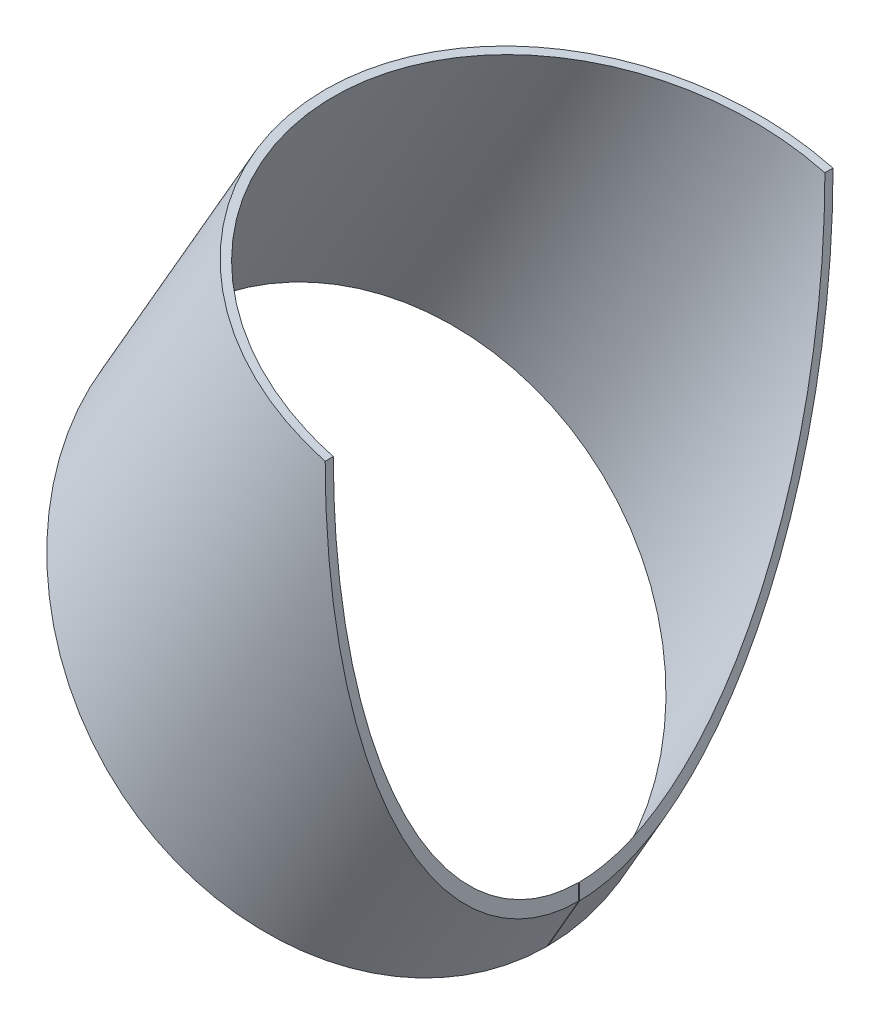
ISO-10303-21;
HEADER;
FILE_DESCRIPTION(('STEP AP214'),'2;1');
FILE_NAME('part.step','',(''),(''),'','','');
FILE_SCHEMA(('AUTOMOTIVE_DESIGN { 1 0 10303 214 1 1 1 1 }'));
ENDSEC;
DATA;
#1=APPLICATION_CONTEXT('core data for automotive mechanical design processes');
#2=APPLICATION_PROTOCOL_DEFINITION('international standard','automotive_design',2000,#1);
#3=PRODUCT_CONTEXT('',#1,'mechanical');
#4=PRODUCT('Part','Part','',(#3));
#5=PRODUCT_RELATED_PRODUCT_CATEGORY('part','',(#4));
#6=PRODUCT_DEFINITION_FORMATION('','',#4);
#7=PRODUCT_DEFINITION_CONTEXT('part definition',#1,'design');
#8=PRODUCT_DEFINITION('design','',#6,#7);
#9=PRODUCT_DEFINITION_SHAPE('','',#8);
#10=(LENGTH_UNIT() NAMED_UNIT(*) SI_UNIT(.MILLI.,.METRE.));
#11=(NAMED_UNIT(*) PLANE_ANGLE_UNIT() SI_UNIT($,.RADIAN.));
#12=(NAMED_UNIT(*) SI_UNIT($,.STERADIAN.) SOLID_ANGLE_UNIT());
#13=UNCERTAINTY_MEASURE_WITH_UNIT(LENGTH_MEASURE(1.E-05),#10,'distance_accuracy_value','');
#14=(GEOMETRIC_REPRESENTATION_CONTEXT(3) GLOBAL_UNCERTAINTY_ASSIGNED_CONTEXT((#13)) GLOBAL_UNIT_ASSIGNED_CONTEXT((#10,
#11,#12)) REPRESENTATION_CONTEXT('',''));
#15=CARTESIAN_POINT('',(0.,0.,0.));
#16=DIRECTION('',(0.,0.,1.));
#17=DIRECTION('',(1.,0.,0.));
#18=AXIS2_PLACEMENT_3D('',#15,#16,#17);
#19=CARTESIAN_POINT('',(33.49364905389,-156.34665205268,0.));
#20=DIRECTION('',(-0.5,-0.866025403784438,0.));
#21=DIRECTION('',(-0.866025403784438,0.500000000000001,0.));
#22=AXIS2_PLACEMENT_3D('',#19,#20,#21);
#23=CYLINDRICAL_SURFACE('',#22,250.);
#24=DIRECTION('',(-0.5,-0.866025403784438,0.));
#25=VECTOR('',#24,1.);
#26=CARTESIAN_POINT('',(249.999566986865,-281.346402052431,-0.500000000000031));
#27=LINE('',#26,#25);
#28=CARTESIAN_POINT('',(-31.3470180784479,-768.652981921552,-0.500000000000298));
#29=VERTEX_POINT('',#28);
#30=CARTESIAN_POINT('',(0.,-714.358353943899,-0.500000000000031));
#31=VERTEX_POINT('',#30);
#32=EDGE_CURVE('E101',#29,#31,#27,.F.);
#33=ORIENTED_EDGE('',*,*,#32,.F.);
#34=CARTESIAN_POINT('',(-214.359353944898,-585.640646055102,0.));
#35=DIRECTION('',(0.707106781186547,0.707106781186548,0.));
#36=DIRECTION('',(0.707106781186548,-0.707106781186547,0.));
#37=AXIS2_PLACEMENT_3D('',#34,#35,#36);
#38=ELLIPSE('',#37,258.819045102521,250.);
#39=CARTESIAN_POINT('',(-31.3470180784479,-768.652981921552,0.500000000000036));
#40=VERTEX_POINT('',#39);
#41=EDGE_CURVE('E97',#40,#29,#38,.F.);
#42=ORIENTED_EDGE('',*,*,#41,.F.);
#43=DIRECTION('',(-0.5,-0.866025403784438,0.));
#44=VECTOR('',#43,1.);
#45=CARTESIAN_POINT('',(249.999566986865,-281.346402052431,0.499999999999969));
#46=LINE('',#45,#44);
#47=CARTESIAN_POINT('',(0.,-714.358353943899,0.499999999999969));
#48=VERTEX_POINT('',#47);
#49=EDGE_CURVE('E82',#40,#48,#46,.F.);
#50=ORIENTED_EDGE('',*,*,#49,.T.);
#51=CARTESIAN_POINT('',(0.,-214.359353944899,0.));
#52=DIRECTION('',(-1.,0.,0.));
#53=DIRECTION('',(0.,-1.,0.));
#54=AXIS2_PLACEMENT_3D('',#51,#52,#53);
#55=ELLIPSE('',#54,500.,250.);
#56=CARTESIAN_POINT('',(0.,-214.3593539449,250.000000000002));
#57=VERTEX_POINT('',#56);
#58=EDGE_CURVE('E88',#57,#48,#55,.F.);
#59=ORIENTED_EDGE('',*,*,#58,.F.);
#60=CARTESIAN_POINT('',(-2.63677968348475E-13,-214.3593539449,0.));
#61=DIRECTION('',(0.258819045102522,0.965925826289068,0.));
#62=DIRECTION('',(-0.965925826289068,0.258819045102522,0.));
#63=AXIS2_PLACEMENT_3D('',#60,#61,#62);
#64=ELLIPSE('',#63,258.819045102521,250.);
#65=CARTESIAN_POINT('',(0.,-214.3593539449,-250.));
#66=VERTEX_POINT('',#65);
#67=EDGE_CURVE('E108',#57,#66,#64,.F.);
#68=ORIENTED_EDGE('',*,*,#67,.T.);
#69=EDGE_CURVE('E94',#31,#66,#55,.F.);
#70=ORIENTED_EDGE('',*,*,#69,.F.);
#71=EDGE_LOOP('',(#33,#42,#50,#59,#68,#70));
#72=FACE_BOUND('',#71,.T.);
#73=ADVANCED_FACE('F30',(#72),#23,.T.);
#74=CARTESIAN_POINT('',(33.49364905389,-156.34665205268,0.));
#75=DIRECTION('',(-0.5,-0.866025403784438,0.));
#76=DIRECTION('',(-0.866025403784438,0.500000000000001,0.));
#77=AXIS2_PLACEMENT_3D('',#74,#75,#76);
#78=CYLINDRICAL_SURFACE('',#77,242.);
#79=CARTESIAN_POINT('',(0.,-214.359353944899,0.));
#80=DIRECTION('',(-1.,0.,0.));
#81=DIRECTION('',(0.,-1.,0.));
#82=AXIS2_PLACEMENT_3D('',#79,#80,#81);
#83=ELLIPSE('',#82,484.,242.);
#84=CARTESIAN_POINT('',(0.,-698.358320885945,-0.50000000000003));
#85=VERTEX_POINT('',#84);
#86=CARTESIAN_POINT('',(0.,-214.3593539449,-242.));
#87=VERTEX_POINT('',#86);
#88=EDGE_CURVE('E122',#85,#87,#83,.F.);
#89=ORIENTED_EDGE('',*,*,#88,.T.);
#90=CARTESIAN_POINT('',(-2.63677968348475E-13,-214.3593539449,0.));
#91=DIRECTION('',(0.258819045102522,0.965925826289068,0.));
#92=DIRECTION('',(-0.965925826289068,0.258819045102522,0.));
#93=AXIS2_PLACEMENT_3D('',#90,#91,#92);
#94=ELLIPSE('',#93,250.53683565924,242.);
#95=CARTESIAN_POINT('',(0.,-214.3593539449,242.000000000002));
#96=VERTEX_POINT('',#95);
#97=EDGE_CURVE('E99',#96,#87,#94,.F.);
#98=ORIENTED_EDGE('',*,*,#97,.F.);
#99=CARTESIAN_POINT('',(0.,-698.358320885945,0.49999999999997));
#100=VERTEX_POINT('',#99);
#101=EDGE_CURVE('E92',#96,#100,#83,.F.);
#102=ORIENTED_EDGE('',*,*,#101,.T.);
#103=DIRECTION('',(-0.5,-0.866025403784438,0.));
#104=VECTOR('',#103,1.);
#105=CARTESIAN_POINT('',(243.071349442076,-277.346393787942,0.49999999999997));
#106=LINE('',#105,#104);
#107=CARTESIAN_POINT('',(-37.2034366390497,-762.79656336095,0.500000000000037));
#108=VERTEX_POINT('',#107);
#109=EDGE_CURVE('E85',#108,#100,#106,.F.);
#110=ORIENTED_EDGE('',*,*,#109,.F.);
#111=CARTESIAN_POINT('',(-214.359353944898,-585.640646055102,0.));
#112=DIRECTION('',(0.707106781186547,0.707106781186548,0.));
#113=DIRECTION('',(0.707106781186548,-0.707106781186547,0.));
#114=AXIS2_PLACEMENT_3D('',#111,#112,#113);
#115=ELLIPSE('',#114,250.53683565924,242.);
#116=CARTESIAN_POINT('',(-37.2034366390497,-762.79656336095,-0.500000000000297));
#117=VERTEX_POINT('',#116);
#118=EDGE_CURVE('E105',#108,#117,#115,.F.);
#119=ORIENTED_EDGE('',*,*,#118,.T.);
#120=DIRECTION('',(-0.5,-0.866025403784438,0.));
#121=VECTOR('',#120,1.);
#122=CARTESIAN_POINT('',(243.071349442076,-277.346393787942,-0.50000000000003));
#123=LINE('',#122,#121);
#124=EDGE_CURVE('E132',#117,#85,#123,.F.);
#125=ORIENTED_EDGE('',*,*,#124,.T.);
#126=EDGE_LOOP('',(#89,#98,#102,#110,#119,#125));
#127=FACE_BOUND('',#126,.T.);
#128=ADVANCED_FACE('F119',(#127),#78,.F.);
#129=CARTESIAN_POINT('',(-800.,0.,2271.05495199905));
#130=DIRECTION('',(-0.258819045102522,-0.965925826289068,0.));
#131=DIRECTION('',(-0.965925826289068,0.258819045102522,0.));
#132=AXIS2_PLACEMENT_3D('',#129,#130,#131);
#133=PLANE('',#132);
#134=DIRECTION('',(0.,0.,-1.));
#135=VECTOR('',#134,1.);
#136=CARTESIAN_POINT('',(0.,-214.3593539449,2271.05495199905));
#137=LINE('',#136,#135);
#138=EDGE_CURVE('E44',#57,#96,#137,.T.);
#139=ORIENTED_EDGE('',*,*,#138,.T.);
#140=ORIENTED_EDGE('',*,*,#97,.T.);
#141=EDGE_CURVE('E126',#87,#66,#137,.T.);
#142=ORIENTED_EDGE('',*,*,#141,.T.);
#143=ORIENTED_EDGE('',*,*,#67,.F.);
#144=EDGE_LOOP('',(#139,#140,#142,#143));
#145=FACE_BOUND('',#144,.T.);
#146=ADVANCED_FACE('F137',(#145),#133,.F.);
#147=CARTESIAN_POINT('',(155.320323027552,54.6633369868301,-0.5));
#148=DIRECTION('',(0.,0.,1.));
#149=DIRECTION('',(-1.,0.,0.));
#150=AXIS2_PLACEMENT_3D('',#147,#148,#149);
#151=PLANE('',#150);
#152=ORIENTED_EDGE('',*,*,#124,.F.);
#153=DIRECTION('',(0.707106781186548,-0.707106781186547,0.));
#154=VECTOR('',#153,1.);
#155=CARTESIAN_POINT('',(-800.,1.93782600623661E-13,-0.500000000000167));
#156=LINE('',#155,#154);
#157=EDGE_CURVE('E107',#117,#29,#156,.T.);
#158=ORIENTED_EDGE('',*,*,#157,.T.);
#159=ORIENTED_EDGE('',*,*,#32,.T.);
#160=DIRECTION('',(0.,-1.,0.));
#161=VECTOR('',#160,1.);
#162=CARTESIAN_POINT('',(0.,54.6633369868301,-0.499999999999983));
#163=LINE('',#162,#161);
#164=EDGE_CURVE('E123',#85,#31,#163,.T.);
#165=ORIENTED_EDGE('',*,*,#164,.F.);
#166=EDGE_LOOP('',(#152,#158,#159,#165));
#167=FACE_BOUND('',#166,.T.);
#168=ADVANCED_FACE('F135',(#167),#151,.T.);
#169=CARTESIAN_POINT('',(155.320323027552,54.6633369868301,0.5));
#170=DIRECTION('',(0.,0.,1.));
#171=DIRECTION('',(-1.,0.,0.));
#172=AXIS2_PLACEMENT_3D('',#169,#170,#171);
#173=PLANE('',#172);
#174=DIRECTION('',(0.,-1.,0.));
#175=VECTOR('',#174,1.);
#176=CARTESIAN_POINT('',(0.,54.6633369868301,0.500000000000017));
#177=LINE('',#176,#175);
#178=EDGE_CURVE('E11',#100,#48,#177,.T.);
#179=ORIENTED_EDGE('',*,*,#178,.T.);
#180=ORIENTED_EDGE('',*,*,#49,.F.);
#181=DIRECTION('',(0.707106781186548,-0.707106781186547,0.));
#182=VECTOR('',#181,1.);
#183=CARTESIAN_POINT('',(-800.,1.93697292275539E-13,0.500000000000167));
#184=LINE('',#183,#182);
#185=EDGE_CURVE('E37',#108,#40,#184,.T.);
#186=ORIENTED_EDGE('',*,*,#185,.F.);
#187=ORIENTED_EDGE('',*,*,#109,.T.);
#188=EDGE_LOOP('',(#179,#180,#186,#187));
#189=FACE_BOUND('',#188,.T.);
#190=ADVANCED_FACE('F80',(#189),#173,.F.);
#191=CARTESIAN_POINT('',(-800.,0.,2271.05495199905));
#192=DIRECTION('',(-0.707106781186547,-0.707106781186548,0.));
#193=DIRECTION('',(-0.707106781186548,0.707106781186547,0.));
#194=AXIS2_PLACEMENT_3D('',#191,#192,#193);
#195=PLANE('',#194);
#196=ORIENTED_EDGE('',*,*,#185,.T.);
#197=ORIENTED_EDGE('',*,*,#41,.T.);
#198=ORIENTED_EDGE('',*,*,#157,.F.);
#199=ORIENTED_EDGE('',*,*,#118,.F.);
#200=EDGE_LOOP('',(#196,#197,#198,#199));
#201=FACE_BOUND('',#200,.T.);
#202=ADVANCED_FACE('F114',(#201),#195,.T.);
#203=CARTESIAN_POINT('',(0.,-1050.,2271.05453316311));
#204=DIRECTION('',(1.,0.,0.));
#205=DIRECTION('',(0.,0.,1.));
#206=AXIS2_PLACEMENT_3D('',#203,#204,#205);
#207=PLANE('',#206);
#208=ORIENTED_EDGE('',*,*,#58,.T.);
#209=ORIENTED_EDGE('',*,*,#178,.F.);
#210=ORIENTED_EDGE('',*,*,#101,.F.);
#211=ORIENTED_EDGE('',*,*,#138,.F.);
#212=EDGE_LOOP('',(#208,#209,#210,#211));
#213=FACE_BOUND('',#212,.T.);
#214=ADVANCED_FACE('F89',(#213),#207,.T.);
#215=ORIENTED_EDGE('',*,*,#88,.F.);
#216=ORIENTED_EDGE('',*,*,#164,.T.);
#217=ORIENTED_EDGE('',*,*,#69,.T.);
#218=ORIENTED_EDGE('',*,*,#141,.F.);
#219=EDGE_LOOP('',(#215,#216,#217,#218));
#220=FACE_BOUND('',#219,.T.);
#221=ADVANCED_FACE('F136',(#220),#207,.T.);
#222=CLOSED_SHELL('',(#73,#128,#146,#168,#190,#202,#214,#221));
#223=MANIFOLD_SOLID_BREP('B2',#222);
#224=ADVANCED_BREP_SHAPE_REPRESENTATION('',(#18,#223),#14);
#225=SHAPE_DEFINITION_REPRESENTATION(#9,#224);
ENDSEC;
END-ISO-10303-21;
